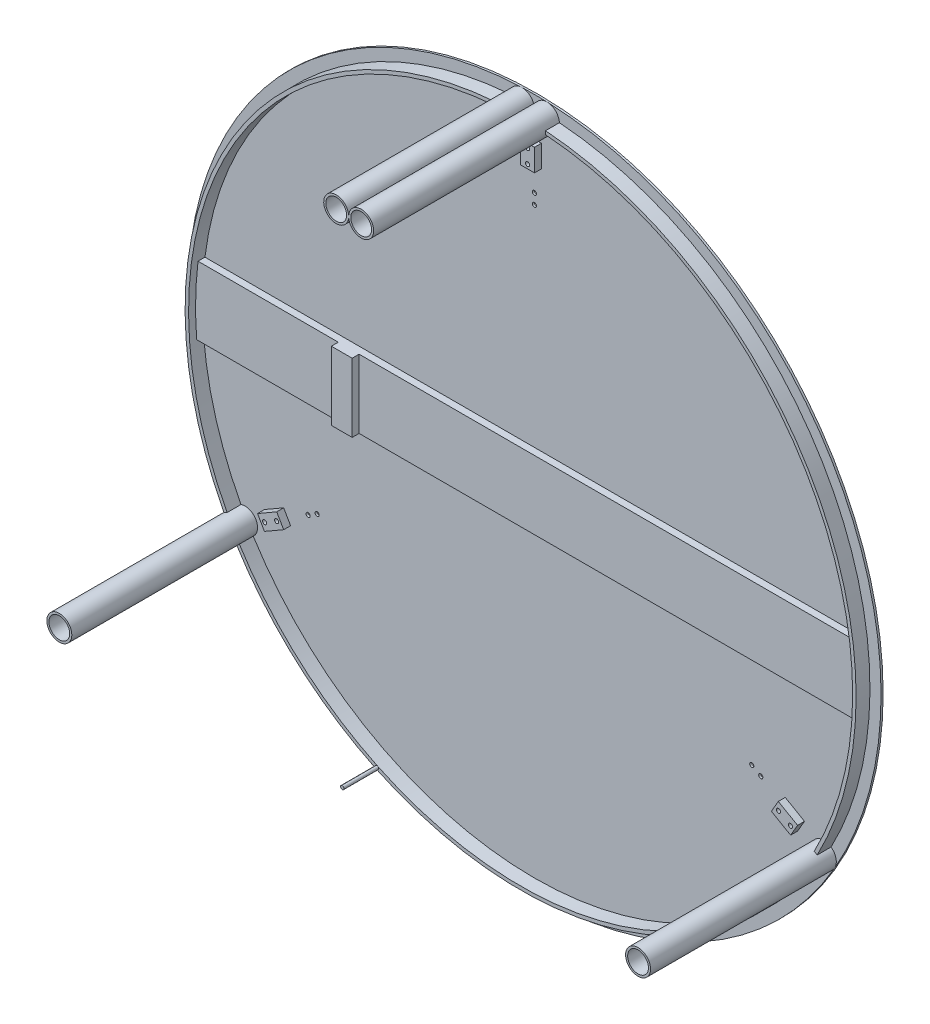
from build123d import *
from build123d.topology import SkipClean

# Parameters (mm, degrees)
ESQUISSE1_R             = 500
EXTRUSION6_DEPTH        = 3
EXTRUSION7_DEPTH        = 20
EXTRUSION10_DEPTH       = 268
ENL_V_START             = -268
ENL_V_MAT_EXTRU_1_DEPTH = 268
ESQUISSE8_R             = 2.5
EXTRUSION11_DEPTH       = 70
EXTRUSION12_DEPTH       = 10
ESQUISSE10_R            = 15
ENL_V_MAT_EXTRU_2_DEPTH = 268
ESQUISSE11_W            = 30
ESQUISSE11_H            = 98.980276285
EXTRUSION13_DEPTH       = 10
ESQUISSE12_W            = 20
ESQUISSE12_H            = 32
EXTRUSION14_DEPTH       = 10
ESQUISSE13_R            = 3
ENL_V_MAT_EXTRU_3_DEPTH = 10
ESQUISSE14_R            = 3
ENL_V_MAT_EXTRU_4_DEPTH = 757.190452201
ESQUISSE15_R            = 5
ENL_V_MAT_EXTRU_5_DEPTH = 757.190452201


with BuildPart() as part:
    # Esquisse1 → Extrusion6 (new body)
    with BuildSketch(Plane.XY):
        Circle(ESQUISSE1_R)
    extrude(amount=EXTRUSION6_DEPTH)

    # Esquisse5 → Extrusion7 (add)
    with BuildSketch(Plane.XY.offset(3)):
        with BuildLine():
            ThreePointArc((-409.90754575, -257.35540394), (0, -484), (409.90754575, -257.35540394))
            ThreePointArc((409.90754575, -257.35540394), (407.708716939, -256.152838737), (405.698231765, -254.656523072))
            ThreePointArc((405.698231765, -254.656523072), (0, -479), (-405.698231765, -254.656523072))
            ThreePointArc((-405.698231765, -254.656523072), (-407.708716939, -256.152838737), (-409.90754575, -257.35540394))
        make_face()
        with BuildLine():
            ThreePointArc((-423.388134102, -224.016713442), (-425.689224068, -225.009686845), (-427.830090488, -226.312645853))
            ThreePointArc((-427.830090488, -226.312645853), (-423.602654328, 234.129859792), (-35.972335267, 482.661362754))
            ThreePointArc((-35.972335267, 482.661362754), (-35.936689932, 480.15542169), (-35.553326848, 477.678721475))
            ThreePointArc((-35.553326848, 477.678721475), (-419.22659385, 231.711162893), (-423.388134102, -224.016713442))
        make_face()
        with BuildLine():
            ThreePointArc((427.830090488, -226.312645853), (423.602654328, 234.129859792), (35.972335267, 482.661362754))
            ThreePointArc((35.972335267, 482.661362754), (35.936689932, 480.15542169), (35.553326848, 477.678721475))
            ThreePointArc((35.553326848, 477.678721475), (419.22659385, 231.711162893), (423.388134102, -224.016713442))
            ThreePointArc((423.388134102, -224.016713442), (425.689224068, -225.009686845), (427.830090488, -226.312645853))
        make_face()
    extrude(amount=EXTRUSION7_DEPTH)

    # Esquisse6 → Extrusion10 (add)
    with BuildSketch(Plane.XY.offset(3)):
        with BuildLine():
            ThreePointArc((-405.698231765, -254.656523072), (0, -479), (405.698231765, -254.656523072))
            ThreePointArc((405.698231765, -254.656523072), (433.012701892, -250), (423.388134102, -224.016713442))
            ThreePointArc((423.388134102, -224.016713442), (419.22659385, 231.711162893), (35.553326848, 477.678721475))
            ThreePointArc((35.553326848, 477.678721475), (20.005008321, 499.551766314), (0, 481.663783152))
            ThreePointArc((0, 481.663783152), (-20.005008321, 499.551766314), (-35.553326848, 477.678721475))
            ThreePointArc((-35.553326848, 477.678721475), (-419.22659385, 231.711162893), (-423.388134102, -224.016713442))
            ThreePointArc((-423.388134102, -224.016713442), (-433.012701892, -250), (-405.698231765, -254.656523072))
        make_face()
    extrude(amount=EXTRUSION10_DEPTH)

    # Esquisse7 → Enl_v. mat.-Extru.1 (cut)
    with SkipClean():  # the faces are left unmerged after this step: merging them gives an invalid solid
        with BuildSketch(Plane.XY.offset(271).offset(ENL_V_START)):
            with BuildLine():
                ThreePointArc((-423.388134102, -224.016713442), (-407.01631521, -226.31412225), (-399.424244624, -241))
                ThreePointArc((-399.424244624, -241), (-401.067774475, -248.514378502), (-405.698231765, -254.656523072))
                ThreePointArc((-405.698231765, -254.656523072), (0, -479), (405.698231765, -254.656523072))
                ThreePointArc((405.698231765, -254.656523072), (401.835787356, -232), (423.388134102, -224.016713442))
                ThreePointArc((423.388134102, -224.016713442), (419.22659385, 231.711162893), (35.553326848, 477.678721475))
                ThreePointArc((35.553326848, 477.678721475), (17.32780083, 463.676338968), (0.19820119, 478.999958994))
                ThreePointArc((0.19820119, 478.999958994), (0, 479), (-0.19820119, 478.999958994))
                ThreePointArc((-0.19820119, 478.999958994), (-17.32780083, 463.676338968), (-35.553326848, 477.678721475))
                ThreePointArc((-35.553326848, 477.678721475), (-419.22659385, 231.711162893), (-423.388134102, -224.016713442))
            make_face()
        extrude(amount=ENL_V_MAT_EXTRU_1_DEPTH, mode=Mode.SUBTRACT)

    # Esquisse8 → Extrusion11 (add)
    with SkipClean():  # the faces are left unmerged after this step: merging them gives an invalid solid
        with BuildSketch(Plane.XY.offset(3)):
            with Locations(Location((-207.291093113, -434.594814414, 0), (0, 0, 244.5))):
                Circle(ESQUISSE8_R)
            with Locations(Location((207.291093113, -434.594814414, 0), (0, 0, 115.5))):
                Circle(ESQUISSE8_R)
        extrude(amount=EXTRUSION11_DEPTH)

    # Esquisse9 → Extrusion12 (add)
    with SkipClean():  # the faces are left unmerged after this step: merging them gives an invalid solid
        with BuildSketch(Plane.XY.offset(3)):
            with BuildLine():
                Line((-475.352500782, 59), (475.352500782, 59))
                ThreePointArc((475.352500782, 59), (478.904569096, 9.561051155), (477.328584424, -39.980276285))
                Line((477.328584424, -39.980276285), (-477.328584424, -39.980276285))
                ThreePointArc((-477.328584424, -39.980276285), (-478.904569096, 9.561051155), (-475.352500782, 59))
            make_face()
        extrude(amount=EXTRUSION12_DEPTH)

    # Esquisse10 → Enl_v. mat.-Extru.2 (cut)
    with SkipClean():  # the faces are left unmerged after this step: merging them gives an invalid solid
        with BuildSketch(Plane.XY.offset(271)):
            with Locations((-417.424244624, -241)):
                Circle(ESQUISSE10_R)
            with Locations((417.424244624, -241)):
                Circle(ESQUISSE10_R)
            with Locations((-18, 481.663783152)):
                Circle(ESQUISSE10_R)
            with Locations((18, 481.663783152)):
                Circle(ESQUISSE10_R)
        extrude(amount=-ENL_V_MAT_EXTRU_2_DEPTH, mode=Mode.SUBTRACT)

    # Esquisse11 → Extrusion13 (add)
    with SkipClean():  # the faces are left unmerged after this step: merging them gives an invalid solid
        with BuildSketch(Plane.XY.offset(13)):
            with Locations((-258, 9.509861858)):
                Rectangle(ESQUISSE11_W, ESQUISSE11_H)
        extrude(amount=EXTRUSION13_DEPTH)

    # Esquisse12 → Extrusion14 (add)
    with SkipClean():  # the faces are left unmerged after this step: merging them gives an invalid solid
        with BuildSketch(Plane.XY.offset(3)):
            with Locations((0, 428)):
                Rectangle(ESQUISSE12_W, ESQUISSE12_H)
            Polygon((-389.51527928, -213.339745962), (-361.802466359, -197.339745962), (-351.802466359, -214.660254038), (-379.51527928, -230.660254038), align=None)
            Polygon((379.51527928, -230.660254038), (351.802466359, -214.660254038), (361.802466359, -197.339745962), (389.51527928, -213.339745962), align=None)
        extrude(amount=EXTRUSION14_DEPTH)

    # Esquisse13 → Enl_v. mat.-Extru.3 (cut)
    with SkipClean():  # the faces are left unmerged after this step: merging them gives an invalid solid
        with BuildSketch(Plane.XY.offset(13)):
            with Locations((0, 438)):
                Circle(ESQUISSE13_R)
            with Locations((0, 418)):
                Circle(ESQUISSE13_R)
            with Locations((-361.998618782, -209)):
                Circle(ESQUISSE13_R)
            with Locations((-379.319126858, -219)):
                Circle(ESQUISSE13_R)
            with Locations((361.998618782, -209)):
                Circle(ESQUISSE13_R)
            with Locations((379.319126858, -219)):
                Circle(ESQUISSE13_R)
        extrude(amount=-ENL_V_MAT_EXTRU_3_DEPTH, mode=Mode.SUBTRACT)

    # Esquisse14 → Enl_v. mat.-Extru.4 (cut, through all)
    with SkipClean():  # the faces are left unmerged after this step: merging them gives an invalid solid
        with BuildSketch(Plane.XY.offset(3)):
            with Locations((-326.491577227, -188.5)):
                Circle(ESQUISSE14_R)
            with Locations((-313.50119617, -181)):
                Circle(ESQUISSE14_R)
            with Locations((326.491577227, -188.5)):
                Circle(ESQUISSE14_R)
            with Locations((313.50119617, -181)):
                Circle(ESQUISSE14_R)
            with Locations((0, 377)):
                Circle(ESQUISSE14_R)
            with Locations((0, 362)):
                Circle(ESQUISSE14_R)
        extrude(amount=-ENL_V_MAT_EXTRU_4_DEPTH, mode=Mode.SUBTRACT)

    # Esquisse15 → Enl_v. mat.-Extru.5 (cut, through all)
    with SkipClean():  # the faces are left unmerged after this step: merging them gives an invalid solid
        with BuildSketch(Plane.XY.offset(3)):
            with Locations((-417.424244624, -241)):
                Circle(ESQUISSE15_R)
            with Locations((417.424244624, -241)):
                Circle(ESQUISSE15_R)
            with Locations((-18, 481.663783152)):
                Circle(ESQUISSE15_R)
            with Locations((18, 481.663783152)):
                Circle(ESQUISSE15_R)
        extrude(amount=-ENL_V_MAT_EXTRU_5_DEPTH, mode=Mode.SUBTRACT)


solid = part.part
